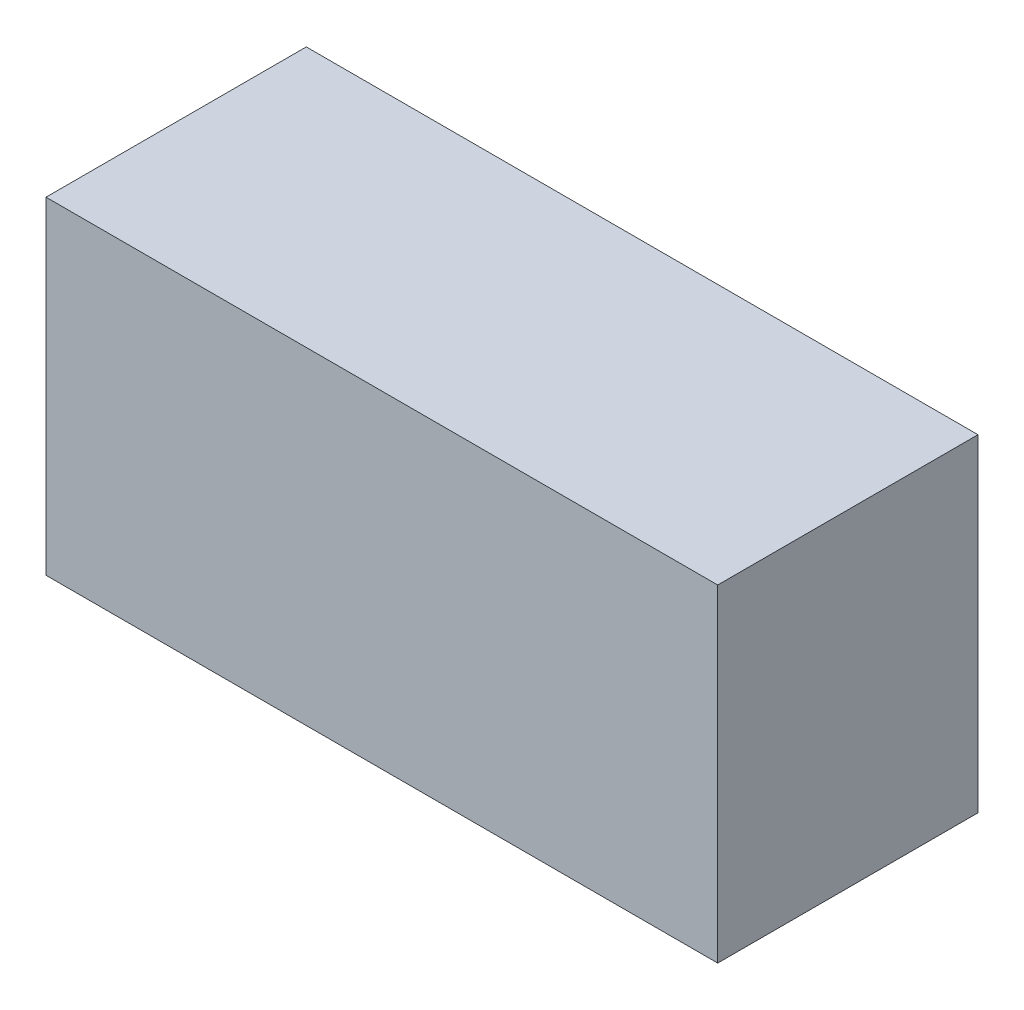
ISO-10303-21;
HEADER;
FILE_DESCRIPTION(('STEP AP214'),'2;1');
FILE_NAME('part.step','',(''),(''),'','','');
FILE_SCHEMA(('AUTOMOTIVE_DESIGN { 1 0 10303 214 1 1 1 1 }'));
ENDSEC;
DATA;
#1=APPLICATION_CONTEXT('core data for automotive mechanical design processes');
#2=APPLICATION_PROTOCOL_DEFINITION('international standard','automotive_design',2000,#1);
#3=PRODUCT_CONTEXT('',#1,'mechanical');
#4=PRODUCT('Part','Part','',(#3));
#5=PRODUCT_RELATED_PRODUCT_CATEGORY('part','',(#4));
#6=PRODUCT_DEFINITION_FORMATION('','',#4);
#7=PRODUCT_DEFINITION_CONTEXT('part definition',#1,'design');
#8=PRODUCT_DEFINITION('design','',#6,#7);
#9=PRODUCT_DEFINITION_SHAPE('','',#8);
#10=(LENGTH_UNIT() NAMED_UNIT(*) SI_UNIT(.MILLI.,.METRE.));
#11=(NAMED_UNIT(*) PLANE_ANGLE_UNIT() SI_UNIT($,.RADIAN.));
#12=(NAMED_UNIT(*) SI_UNIT($,.STERADIAN.) SOLID_ANGLE_UNIT());
#13=UNCERTAINTY_MEASURE_WITH_UNIT(LENGTH_MEASURE(1.E-05),#10,'distance_accuracy_value','');
#14=(GEOMETRIC_REPRESENTATION_CONTEXT(3) GLOBAL_UNCERTAINTY_ASSIGNED_CONTEXT((#13)) GLOBAL_UNIT_ASSIGNED_CONTEXT((#10,
#11,#12)) REPRESENTATION_CONTEXT('',''));
#15=CARTESIAN_POINT('',(0.,0.,0.));
#16=DIRECTION('',(0.,0.,1.));
#17=DIRECTION('',(1.,0.,0.));
#18=AXIS2_PLACEMENT_3D('',#15,#16,#17);
#19=CARTESIAN_POINT('',(40.,-9.75,7.75));
#20=DIRECTION('',(0.,1.,0.));
#21=DIRECTION('',(0.,0.,1.));
#22=AXIS2_PLACEMENT_3D('',#19,#20,#21);
#23=PLANE('',#22);
#24=DIRECTION('',(0.,0.,-1.));
#25=VECTOR('',#24,1.);
#26=CARTESIAN_POINT('',(0.,-9.75,7.75));
#27=LINE('',#26,#25);
#28=CARTESIAN_POINT('',(0.,-9.75,7.75));
#29=VERTEX_POINT('',#28);
#30=CARTESIAN_POINT('',(0.,-9.75,-7.75));
#31=VERTEX_POINT('',#30);
#32=EDGE_CURVE('E102',#29,#31,#27,.T.);
#33=ORIENTED_EDGE('',*,*,#32,.T.);
#34=DIRECTION('',(-1.,0.,0.));
#35=VECTOR('',#34,1.);
#36=CARTESIAN_POINT('',(40.,-9.75,-7.75));
#37=LINE('',#36,#35);
#38=CARTESIAN_POINT('',(40.,-9.75,-7.75));
#39=VERTEX_POINT('',#38);
#40=EDGE_CURVE('E11',#39,#31,#37,.T.);
#41=ORIENTED_EDGE('',*,*,#40,.F.);
#42=DIRECTION('',(0.,0.,-1.));
#43=VECTOR('',#42,1.);
#44=CARTESIAN_POINT('',(40.,-9.75,7.75));
#45=LINE('',#44,#43);
#46=CARTESIAN_POINT('',(40.,-9.75,7.75));
#47=VERTEX_POINT('',#46);
#48=EDGE_CURVE('E79',#47,#39,#45,.T.);
#49=ORIENTED_EDGE('',*,*,#48,.F.);
#50=DIRECTION('',(-1.,0.,0.));
#51=VECTOR('',#50,1.);
#52=CARTESIAN_POINT('',(40.,-9.75,7.75));
#53=LINE('',#52,#51);
#54=EDGE_CURVE('E98',#47,#29,#53,.T.);
#55=ORIENTED_EDGE('',*,*,#54,.T.);
#56=EDGE_LOOP('',(#33,#41,#49,#55));
#57=FACE_BOUND('',#56,.T.);
#58=ADVANCED_FACE('F40',(#57),#23,.F.);
#59=CARTESIAN_POINT('',(40.,9.75,-7.75));
#60=DIRECTION('',(0.,0.,-1.));
#61=DIRECTION('',(0.,1.,0.));
#62=AXIS2_PLACEMENT_3D('',#59,#60,#61);
#63=PLANE('',#62);
#64=DIRECTION('',(0.,-1.,0.));
#65=VECTOR('',#64,1.);
#66=CARTESIAN_POINT('',(0.,9.75,-7.75));
#67=LINE('',#66,#65);
#68=CARTESIAN_POINT('',(0.,9.75,-7.75));
#69=VERTEX_POINT('',#68);
#70=EDGE_CURVE('E88',#69,#31,#67,.T.);
#71=ORIENTED_EDGE('',*,*,#70,.F.);
#72=DIRECTION('',(-1.,0.,0.));
#73=VECTOR('',#72,1.);
#74=CARTESIAN_POINT('',(40.,9.75,-7.75));
#75=LINE('',#74,#73);
#76=CARTESIAN_POINT('',(40.,9.75,-7.75));
#77=VERTEX_POINT('',#76);
#78=EDGE_CURVE('E48',#77,#69,#75,.T.);
#79=ORIENTED_EDGE('',*,*,#78,.F.);
#80=DIRECTION('',(0.,-1.,0.));
#81=VECTOR('',#80,1.);
#82=CARTESIAN_POINT('',(40.,9.75,-7.75));
#83=LINE('',#82,#81);
#84=EDGE_CURVE('E86',#77,#39,#83,.T.);
#85=ORIENTED_EDGE('',*,*,#84,.T.);
#86=ORIENTED_EDGE('',*,*,#40,.T.);
#87=EDGE_LOOP('',(#71,#79,#85,#86));
#88=FACE_BOUND('',#87,.T.);
#89=ADVANCED_FACE('F85',(#88),#63,.T.);
#90=CARTESIAN_POINT('',(40.,9.75,7.75));
#91=DIRECTION('',(0.,1.,0.));
#92=DIRECTION('',(0.,0.,1.));
#93=AXIS2_PLACEMENT_3D('',#90,#91,#92);
#94=PLANE('',#93);
#95=DIRECTION('',(0.,0.,-1.));
#96=VECTOR('',#95,1.);
#97=CARTESIAN_POINT('',(0.,9.75,7.75));
#98=LINE('',#97,#96);
#99=CARTESIAN_POINT('',(0.,9.75,7.75));
#100=VERTEX_POINT('',#99);
#101=EDGE_CURVE('E106',#100,#69,#98,.T.);
#102=ORIENTED_EDGE('',*,*,#101,.F.);
#103=DIRECTION('',(-1.,0.,0.));
#104=VECTOR('',#103,1.);
#105=CARTESIAN_POINT('',(40.,9.75,7.75));
#106=LINE('',#105,#104);
#107=CARTESIAN_POINT('',(40.,9.75,7.75));
#108=VERTEX_POINT('',#107);
#109=EDGE_CURVE('E71',#108,#100,#106,.T.);
#110=ORIENTED_EDGE('',*,*,#109,.F.);
#111=DIRECTION('',(0.,0.,-1.));
#112=VECTOR('',#111,1.);
#113=CARTESIAN_POINT('',(40.,9.75,7.75));
#114=LINE('',#113,#112);
#115=EDGE_CURVE('E94',#108,#77,#114,.T.);
#116=ORIENTED_EDGE('',*,*,#115,.T.);
#117=ORIENTED_EDGE('',*,*,#78,.T.);
#118=EDGE_LOOP('',(#102,#110,#116,#117));
#119=FACE_BOUND('',#118,.T.);
#120=ADVANCED_FACE('F96',(#119),#94,.T.);
#121=CARTESIAN_POINT('',(40.,9.75,7.75));
#122=DIRECTION('',(0.,0.,-1.));
#123=DIRECTION('',(0.,1.,0.));
#124=AXIS2_PLACEMENT_3D('',#121,#122,#123);
#125=PLANE('',#124);
#126=DIRECTION('',(0.,-1.,0.));
#127=VECTOR('',#126,1.);
#128=CARTESIAN_POINT('',(0.,9.75,7.75));
#129=LINE('',#128,#127);
#130=EDGE_CURVE('E74',#100,#29,#129,.T.);
#131=ORIENTED_EDGE('',*,*,#130,.T.);
#132=ORIENTED_EDGE('',*,*,#54,.F.);
#133=DIRECTION('',(0.,-1.,0.));
#134=VECTOR('',#133,1.);
#135=CARTESIAN_POINT('',(40.,9.75,7.75));
#136=LINE('',#135,#134);
#137=EDGE_CURVE('E56',#108,#47,#136,.T.);
#138=ORIENTED_EDGE('',*,*,#137,.F.);
#139=ORIENTED_EDGE('',*,*,#109,.T.);
#140=EDGE_LOOP('',(#131,#132,#138,#139));
#141=FACE_BOUND('',#140,.T.);
#142=ADVANCED_FACE('F119',(#141),#125,.F.);
#143=CARTESIAN_POINT('',(40.,0.,0.));
#144=DIRECTION('',(-1.,0.,0.));
#145=DIRECTION('',(0.,0.,1.));
#146=AXIS2_PLACEMENT_3D('',#143,#144,#145);
#147=PLANE('',#146);
#148=ORIENTED_EDGE('',*,*,#48,.T.);
#149=ORIENTED_EDGE('',*,*,#84,.F.);
#150=ORIENTED_EDGE('',*,*,#115,.F.);
#151=ORIENTED_EDGE('',*,*,#137,.T.);
#152=EDGE_LOOP('',(#148,#149,#150,#151));
#153=FACE_BOUND('',#152,.T.);
#154=ADVANCED_FACE('F93',(#153),#147,.F.);
#155=CARTESIAN_POINT('',(0.,0.,0.));
#156=DIRECTION('',(-1.,0.,0.));
#157=DIRECTION('',(0.,0.,1.));
#158=AXIS2_PLACEMENT_3D('',#155,#156,#157);
#159=PLANE('',#158);
#160=ORIENTED_EDGE('',*,*,#32,.F.);
#161=ORIENTED_EDGE('',*,*,#130,.F.);
#162=ORIENTED_EDGE('',*,*,#101,.T.);
#163=ORIENTED_EDGE('',*,*,#70,.T.);
#164=EDGE_LOOP('',(#160,#161,#162,#163));
#165=FACE_BOUND('',#164,.T.);
#166=ADVANCED_FACE('F113',(#165),#159,.T.);
#167=CLOSED_SHELL('',(#58,#89,#120,#142,#154,#166));
#168=MANIFOLD_SOLID_BREP('B2',#167);
#169=ADVANCED_BREP_SHAPE_REPRESENTATION('',(#18,#168),#14);
#170=SHAPE_DEFINITION_REPRESENTATION(#9,#169);
ENDSEC;
END-ISO-10303-21;
